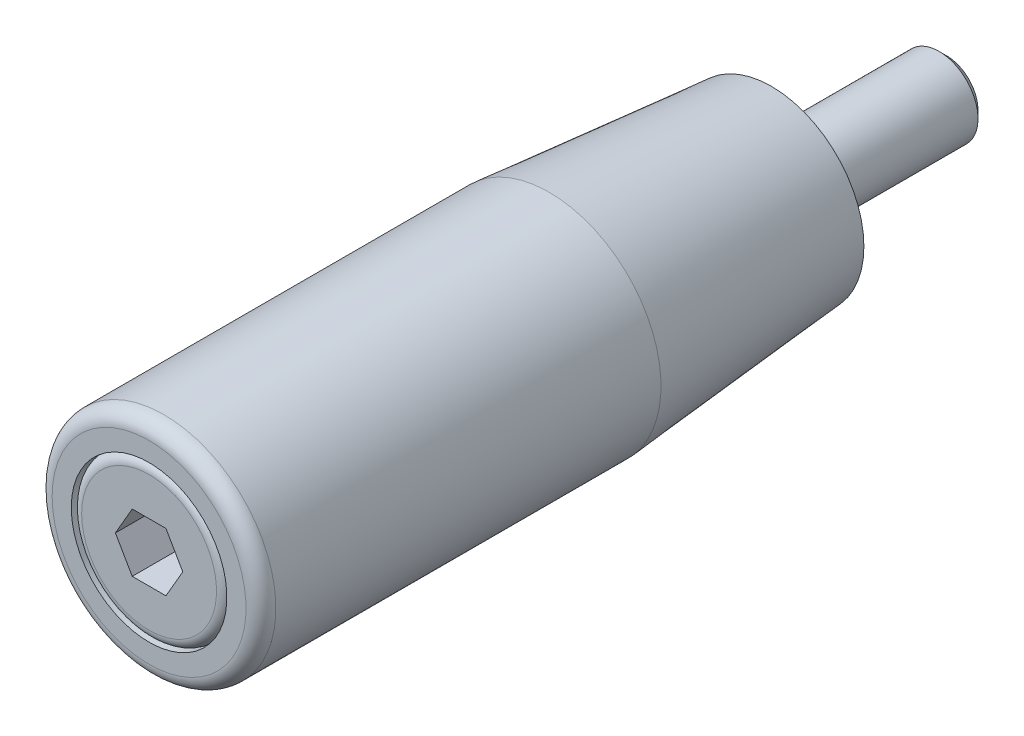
ISO-10303-21;
HEADER;
FILE_DESCRIPTION(('STEP AP214'),'2;1');
FILE_NAME('part.step','',(''),(''),'','','');
FILE_SCHEMA(('AUTOMOTIVE_DESIGN { 1 0 10303 214 1 1 1 1 }'));
ENDSEC;
DATA;
#1=APPLICATION_CONTEXT('core data for automotive mechanical design processes');
#2=APPLICATION_PROTOCOL_DEFINITION('international standard','automotive_design',2000,#1);
#3=PRODUCT_CONTEXT('',#1,'mechanical');
#4=PRODUCT('Part','Part','',(#3));
#5=PRODUCT_RELATED_PRODUCT_CATEGORY('part','',(#4));
#6=PRODUCT_DEFINITION_FORMATION('','',#4);
#7=PRODUCT_DEFINITION_CONTEXT('part definition',#1,'design');
#8=PRODUCT_DEFINITION('design','',#6,#7);
#9=PRODUCT_DEFINITION_SHAPE('','',#8);
#10=(LENGTH_UNIT() NAMED_UNIT(*) SI_UNIT(.MILLI.,.METRE.));
#11=(NAMED_UNIT(*) PLANE_ANGLE_UNIT() SI_UNIT($,.RADIAN.));
#12=(NAMED_UNIT(*) SI_UNIT($,.STERADIAN.) SOLID_ANGLE_UNIT());
#13=UNCERTAINTY_MEASURE_WITH_UNIT(LENGTH_MEASURE(1.E-05),#10,'distance_accuracy_value','');
#14=(GEOMETRIC_REPRESENTATION_CONTEXT(3) GLOBAL_UNCERTAINTY_ASSIGNED_CONTEXT((#13)) GLOBAL_UNIT_ASSIGNED_CONTEXT((#10,
#11,#12)) REPRESENTATION_CONTEXT('',''));
#15=CARTESIAN_POINT('',(0.,0.,0.));
#16=DIRECTION('',(0.,0.,1.));
#17=DIRECTION('',(1.,0.,0.));
#18=AXIS2_PLACEMENT_3D('',#15,#16,#17);
#19=CARTESIAN_POINT('',(0.,-3.,0.));
#20=DIRECTION('',(0.,0.,1.));
#21=DIRECTION('',(-1.,0.,0.));
#22=AXIS2_PLACEMENT_3D('',#19,#20,#21);
#23=PLANE('',#22);
#24=CARTESIAN_POINT('',(0.,0.,0.));
#25=DIRECTION('',(0.,0.,1.));
#26=DIRECTION('',(-1.,0.,0.));
#27=AXIS2_PLACEMENT_3D('',#24,#25,#26);
#28=CIRCLE('',#27,6.);
#29=CARTESIAN_POINT('',(-6.,0.,0.));
#30=VERTEX_POINT('',#29);
#31=EDGE_CURVE('E121',#30,#30,#28,.T.);
#32=ORIENTED_EDGE('',*,*,#31,.F.);
#33=EDGE_LOOP('',(#32));
#34=FACE_BOUND('',#33,.T.);
#35=CARTESIAN_POINT('',(0.,0.,0.));
#36=DIRECTION('',(0.,0.,1.));
#37=DIRECTION('',(-1.,0.,0.));
#38=AXIS2_PLACEMENT_3D('',#35,#36,#37);
#39=CIRCLE('',#38,3.);
#40=CARTESIAN_POINT('',(-3.,0.,0.));
#41=VERTEX_POINT('',#40);
#42=EDGE_CURVE('E124',#41,#41,#39,.T.);
#43=ORIENTED_EDGE('',*,*,#42,.T.);
#44=EDGE_LOOP('',(#43));
#45=FACE_BOUND('',#44,.T.);
#46=ADVANCED_FACE('F15',(#34,#45),#23,.F.);
#47=CARTESIAN_POINT('',(0.,-4.53892574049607E-13,65.));
#48=DIRECTION('',(0.,0.,1.));
#49=DIRECTION('',(-1.,0.,0.));
#50=AXIS2_PLACEMENT_3D('',#47,#48,#49);
#51=CYLINDRICAL_SURFACE('',#50,3.);
#52=ORIENTED_EDGE('',*,*,#42,.F.);
#53=EDGE_LOOP('',(#52));
#54=FACE_BOUND('',#53,.T.);
#55=CARTESIAN_POINT('',(0.,0.,-1.5));
#56=DIRECTION('',(0.,0.,1.));
#57=DIRECTION('',(-1.,0.,0.));
#58=AXIS2_PLACEMENT_3D('',#55,#56,#57);
#59=CIRCLE('',#58,3.);
#60=CARTESIAN_POINT('',(-3.,0.,-1.5));
#61=VERTEX_POINT('',#60);
#62=EDGE_CURVE('E127',#61,#61,#59,.T.);
#63=ORIENTED_EDGE('',*,*,#62,.T.);
#64=EDGE_LOOP('',(#63));
#65=FACE_BOUND('',#64,.T.);
#66=ADVANCED_FACE('F246',(#54,#65),#51,.T.);
#67=CARTESIAN_POINT('',(0.,-3.233,-1.50000000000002));
#68=DIRECTION('',(0.,0.,-1.));
#69=DIRECTION('',(1.,0.,0.));
#70=AXIS2_PLACEMENT_3D('',#67,#68,#69);
#71=PLANE('',#70);
#72=ORIENTED_EDGE('',*,*,#62,.F.);
#73=EDGE_LOOP('',(#72));
#74=FACE_BOUND('',#73,.T.);
#75=CARTESIAN_POINT('',(0.,0.,-1.5));
#76=DIRECTION('',(0.,0.,1.));
#77=DIRECTION('',(-1.,0.,0.));
#78=AXIS2_PLACEMENT_3D('',#75,#76,#77);
#79=CIRCLE('',#78,3.233);
#80=CARTESIAN_POINT('',(-3.233,0.,-1.5));
#81=VERTEX_POINT('',#80);
#82=EDGE_CURVE('E130',#81,#81,#79,.T.);
#83=ORIENTED_EDGE('',*,*,#82,.T.);
#84=EDGE_LOOP('',(#83));
#85=FACE_BOUND('',#84,.T.);
#86=ADVANCED_FACE('F242',(#74,#85),#71,.F.);
#87=CARTESIAN_POINT('',(0.,0.,-2.267));
#88=DIRECTION('',(0.,0.,-1.));
#89=DIRECTION('',(1.,0.,0.));
#90=AXIS2_PLACEMENT_3D('',#87,#88,#89);
#91=CONICAL_SURFACE('',#90,4.,0.785398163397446);
#92=ORIENTED_EDGE('',*,*,#82,.F.);
#93=EDGE_LOOP('',(#92));
#94=FACE_BOUND('',#93,.T.);
#95=CARTESIAN_POINT('',(0.,0.,-2.267));
#96=DIRECTION('',(0.,0.,1.));
#97=DIRECTION('',(-1.,0.,0.));
#98=AXIS2_PLACEMENT_3D('',#95,#96,#97);
#99=CIRCLE('',#98,4.);
#100=CARTESIAN_POINT('',(-4.,0.,-2.267));
#101=VERTEX_POINT('',#100);
#102=EDGE_CURVE('E133',#101,#101,#99,.T.);
#103=ORIENTED_EDGE('',*,*,#102,.T.);
#104=EDGE_LOOP('',(#103));
#105=FACE_BOUND('',#104,.T.);
#106=ADVANCED_FACE('F238',(#94,#105),#91,.T.);
#107=CARTESIAN_POINT('',(0.,-4.53892574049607E-13,65.));
#108=DIRECTION('',(0.,0.,1.));
#109=DIRECTION('',(-1.,0.,0.));
#110=AXIS2_PLACEMENT_3D('',#107,#108,#109);
#111=CYLINDRICAL_SURFACE('',#110,4.);
#112=ORIENTED_EDGE('',*,*,#102,.F.);
#113=EDGE_LOOP('',(#112));
#114=FACE_BOUND('',#113,.T.);
#115=CARTESIAN_POINT('',(0.,1.13354433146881E-13,-16.233));
#116=DIRECTION('',(0.,0.,1.));
#117=DIRECTION('',(-1.,0.,0.));
#118=AXIS2_PLACEMENT_3D('',#115,#116,#117);
#119=CIRCLE('',#118,4.);
#120=CARTESIAN_POINT('',(-4.,1.13354433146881E-13,-16.233));
#121=VERTEX_POINT('',#120);
#122=EDGE_CURVE('E136',#121,#121,#119,.T.);
#123=ORIENTED_EDGE('',*,*,#122,.T.);
#124=EDGE_LOOP('',(#123));
#125=FACE_BOUND('',#124,.T.);
#126=ADVANCED_FACE('F234',(#114,#125),#111,.T.);
#127=CARTESIAN_POINT('',(0.,1.18710365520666E-13,-17.));
#128=DIRECTION('',(0.,0.,1.));
#129=DIRECTION('',(-1.,0.,0.));
#130=AXIS2_PLACEMENT_3D('',#127,#128,#129);
#131=CONICAL_SURFACE('',#130,3.233,0.785398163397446);
#132=ORIENTED_EDGE('',*,*,#122,.F.);
#133=EDGE_LOOP('',(#132));
#134=FACE_BOUND('',#133,.T.);
#135=CARTESIAN_POINT('',(0.,1.18710365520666E-13,-17.));
#136=DIRECTION('',(0.,0.,1.));
#137=DIRECTION('',(-1.,0.,0.));
#138=AXIS2_PLACEMENT_3D('',#135,#136,#137);
#139=CIRCLE('',#138,3.233);
#140=CARTESIAN_POINT('',(-3.233,1.18710365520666E-13,-17.));
#141=VERTEX_POINT('',#140);
#142=EDGE_CURVE('E139',#141,#141,#139,.T.);
#143=ORIENTED_EDGE('',*,*,#142,.T.);
#144=EDGE_LOOP('',(#143));
#145=FACE_BOUND('',#144,.T.);
#146=ADVANCED_FACE('F230',(#134,#145),#131,.T.);
#147=CARTESIAN_POINT('',(0.,1.18710365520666E-13,-17.));
#148=DIRECTION('',(0.,0.,1.));
#149=DIRECTION('',(-1.,0.,0.));
#150=AXIS2_PLACEMENT_3D('',#147,#148,#149);
#151=PLANE('',#150);
#152=ORIENTED_EDGE('',*,*,#142,.F.);
#153=EDGE_LOOP('',(#152));
#154=FACE_BOUND('',#153,.T.);
#155=ADVANCED_FACE('F202',(#154),#151,.F.);
#156=CARTESIAN_POINT('',(0.,-4.53892574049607E-13,65.));
#157=DIRECTION('',(0.,0.,1.));
#158=DIRECTION('',(-1.,0.,0.));
#159=AXIS2_PLACEMENT_3D('',#156,#157,#158);
#160=CYLINDRICAL_SURFACE('',#159,6.);
#161=CARTESIAN_POINT('',(0.,0.,1.));
#162=DIRECTION('',(0.,0.,-1.));
#163=DIRECTION('',(1.,0.,0.));
#164=AXIS2_PLACEMENT_3D('',#161,#162,#163);
#165=CIRCLE('',#164,6.);
#166=CARTESIAN_POINT('',(6.,0.,1.));
#167=VERTEX_POINT('',#166);
#168=EDGE_CURVE('E9',#167,#167,#165,.T.);
#169=ORIENTED_EDGE('',*,*,#168,.T.);
#170=EDGE_LOOP('',(#169));
#171=FACE_BOUND('',#170,.T.);
#172=ORIENTED_EDGE('',*,*,#31,.T.);
#173=EDGE_LOOP('',(#172));
#174=FACE_BOUND('',#173,.T.);
#175=ADVANCED_FACE('F194',(#171,#174),#160,.T.);
#176=CARTESIAN_POINT('',(0.,-4.53892574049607E-13,65.));
#177=DIRECTION('',(0.,0.,1.));
#178=DIRECTION('',(-1.,0.,0.));
#179=AXIS2_PLACEMENT_3D('',#176,#177,#178);
#180=CYLINDRICAL_SURFACE('',#179,8.);
#181=CARTESIAN_POINT('',(0.,-4.53892574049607E-13,65.));
#182=DIRECTION('',(0.,0.,1.));
#183=DIRECTION('',(-1.,0.,0.));
#184=AXIS2_PLACEMENT_3D('',#181,#182,#183);
#185=CIRCLE('',#184,8.);
#186=CARTESIAN_POINT('',(-8.,-4.53892574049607E-13,65.));
#187=VERTEX_POINT('',#186);
#188=EDGE_CURVE('E167',#187,#187,#185,.T.);
#189=ORIENTED_EDGE('',*,*,#188,.T.);
#190=EDGE_LOOP('',(#189));
#191=FACE_BOUND('',#190,.T.);
#192=CARTESIAN_POINT('',(0.,-4.46444080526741E-13,63.9333333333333));
#193=DIRECTION('',(0.,0.,1.));
#194=DIRECTION('',(-1.,0.,0.));
#195=AXIS2_PLACEMENT_3D('',#192,#193,#194);
#196=CIRCLE('',#195,8.);
#197=CARTESIAN_POINT('',(-8.,-4.46444080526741E-13,63.9333333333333));
#198=VERTEX_POINT('',#197);
#199=EDGE_CURVE('E112',#198,#198,#196,.T.);
#200=ORIENTED_EDGE('',*,*,#199,.F.);
#201=EDGE_LOOP('',(#200));
#202=FACE_BOUND('',#201,.T.);
#203=ADVANCED_FACE('F180',(#191,#202),#180,.F.);
#204=CARTESIAN_POINT('',(0.,-8.00000000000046,65.));
#205=DIRECTION('',(0.,0.,1.));
#206=DIRECTION('',(-1.,0.,0.));
#207=AXIS2_PLACEMENT_3D('',#204,#205,#206);
#208=PLANE('',#207);
#209=CARTESIAN_POINT('',(0.,-4.53892574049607E-13,65.));
#210=DIRECTION('',(0.,0.,1.));
#211=DIRECTION('',(-1.,0.,0.));
#212=AXIS2_PLACEMENT_3D('',#209,#210,#211);
#213=CIRCLE('',#212,9.96666666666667);
#214=CARTESIAN_POINT('',(-9.96666666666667,-4.53892574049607E-13,65.));
#215=VERTEX_POINT('',#214);
#216=EDGE_CURVE('E165',#215,#215,#213,.T.);
#217=ORIENTED_EDGE('',*,*,#216,.T.);
#218=EDGE_LOOP('',(#217));
#219=FACE_BOUND('',#218,.T.);
#220=ORIENTED_EDGE('',*,*,#188,.F.);
#221=EDGE_LOOP('',(#220));
#222=FACE_BOUND('',#221,.T.);
#223=ADVANCED_FACE('F211',(#219,#222),#208,.T.);
#224=CARTESIAN_POINT('',(0.,-4.43185364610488E-13,63.4666666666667));
#225=DIRECTION('',(0.,0.,1.));
#226=DIRECTION('',(-1.,0.,0.));
#227=AXIS2_PLACEMENT_3D('',#224,#225,#226);
#228=TOROIDAL_SURFACE('',#227,9.96666666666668,1.53333333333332);
#229=CARTESIAN_POINT('',(0.,-4.43185364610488E-13,63.4666666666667));
#230=DIRECTION('',(0.,0.,1.));
#231=DIRECTION('',(-1.,0.,0.));
#232=AXIS2_PLACEMENT_3D('',#229,#230,#231);
#233=CIRCLE('',#232,11.5);
#234=CARTESIAN_POINT('',(-11.5,-4.43185364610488E-13,63.4666666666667));
#235=VERTEX_POINT('',#234);
#236=EDGE_CURVE('E162',#235,#235,#233,.T.);
#237=ORIENTED_EDGE('',*,*,#236,.T.);
#238=EDGE_LOOP('',(#237));
#239=FACE_BOUND('',#238,.T.);
#240=ORIENTED_EDGE('',*,*,#216,.F.);
#241=EDGE_LOOP('',(#240));
#242=FACE_BOUND('',#241,.T.);
#243=ADVANCED_FACE('F214',(#239,#242),#228,.T.);
#244=CARTESIAN_POINT('',(0.,-9.5,0.999999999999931));
#245=DIRECTION('',(0.,0.,-1.));
#246=DIRECTION('',(1.,0.,0.));
#247=AXIS2_PLACEMENT_3D('',#244,#245,#246);
#248=PLANE('',#247);
#249=ORIENTED_EDGE('',*,*,#168,.F.);
#250=EDGE_LOOP('',(#249));
#251=FACE_BOUND('',#250,.T.);
#252=CARTESIAN_POINT('',(0.,0.,1.));
#253=DIRECTION('',(0.,0.,1.));
#254=DIRECTION('',(-1.,0.,0.));
#255=AXIS2_PLACEMENT_3D('',#252,#253,#254);
#256=CIRCLE('',#255,9.5);
#257=CARTESIAN_POINT('',(-9.5,0.,1.));
#258=VERTEX_POINT('',#257);
#259=EDGE_CURVE('E156',#258,#258,#256,.T.);
#260=ORIENTED_EDGE('',*,*,#259,.F.);
#261=EDGE_LOOP('',(#260));
#262=FACE_BOUND('',#261,.T.);
#263=ADVANCED_FACE('F17',(#251,#262),#248,.T.);
#264=CARTESIAN_POINT('',(0.,-1.66614219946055E-13,23.8601046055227));
#265=DIRECTION('',(0.,0.,1.));
#266=DIRECTION('',(-1.,0.,0.));
#267=AXIS2_PLACEMENT_3D('',#264,#265,#266);
#268=CONICAL_SURFACE('',#267,11.5,0.0872664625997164);
#269=ORIENTED_EDGE('',*,*,#259,.T.);
#270=EDGE_LOOP('',(#269));
#271=FACE_BOUND('',#270,.T.);
#272=CARTESIAN_POINT('',(0.,-1.66614219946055E-13,23.8601046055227));
#273=DIRECTION('',(0.,0.,1.));
#274=DIRECTION('',(-1.,0.,0.));
#275=AXIS2_PLACEMENT_3D('',#272,#273,#274);
#276=CIRCLE('',#275,11.5);
#277=CARTESIAN_POINT('',(-11.5,-1.66614219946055E-13,23.8601046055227));
#278=VERTEX_POINT('',#277);
#279=EDGE_CURVE('E159',#278,#278,#276,.T.);
#280=ORIENTED_EDGE('',*,*,#279,.F.);
#281=EDGE_LOOP('',(#280));
#282=FACE_BOUND('',#281,.T.);
#283=ADVANCED_FACE('F223',(#271,#282),#268,.T.);
#284=CARTESIAN_POINT('',(0.,-4.53892574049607E-13,65.));
#285=DIRECTION('',(0.,0.,1.));
#286=DIRECTION('',(-1.,0.,0.));
#287=AXIS2_PLACEMENT_3D('',#284,#285,#286);
#288=CYLINDRICAL_SURFACE('',#287,11.5);
#289=ORIENTED_EDGE('',*,*,#279,.T.);
#290=EDGE_LOOP('',(#289));
#291=FACE_BOUND('',#290,.T.);
#292=ORIENTED_EDGE('',*,*,#236,.F.);
#293=EDGE_LOOP('',(#292));
#294=FACE_BOUND('',#293,.T.);
#295=ADVANCED_FACE('F219',(#291,#294),#288,.T.);
#296=CARTESIAN_POINT('',(0.,-4.46444080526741E-13,63.9333333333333));
#297=DIRECTION('',(0.,0.,1.));
#298=DIRECTION('',(-1.,0.,0.));
#299=AXIS2_PLACEMENT_3D('',#296,#297,#298);
#300=TOROIDAL_SURFACE('',#299,6.93333333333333,1.06666666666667);
#301=ORIENTED_EDGE('',*,*,#199,.T.);
#302=EDGE_LOOP('',(#301));
#303=FACE_BOUND('',#302,.T.);
#304=CARTESIAN_POINT('',(0.,-4.53892574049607E-13,65.));
#305=DIRECTION('',(0.,0.,1.));
#306=DIRECTION('',(-1.,0.,0.));
#307=AXIS2_PLACEMENT_3D('',#304,#305,#306);
#308=CIRCLE('',#307,6.93333333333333);
#309=CARTESIAN_POINT('',(-6.93333333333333,-4.53892574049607E-13,65.));
#310=VERTEX_POINT('',#309);
#311=EDGE_CURVE('E85',#310,#310,#308,.T.);
#312=ORIENTED_EDGE('',*,*,#311,.F.);
#313=EDGE_LOOP('',(#312));
#314=FACE_BOUND('',#313,.T.);
#315=ADVANCED_FACE('F222',(#303,#314),#300,.T.);
#316=CARTESIAN_POINT('',(0.,-6.93333333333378,65.));
#317=DIRECTION('',(0.,0.,-1.));
#318=DIRECTION('',(1.,0.,0.));
#319=AXIS2_PLACEMENT_3D('',#316,#317,#318);
#320=PLANE('',#319);
#321=DIRECTION('',(1.,0.,0.));
#322=VECTOR('',#321,1.);
#323=CARTESIAN_POINT('',(0.,-3.00000000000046,65.));
#324=LINE('',#323,#322);
#325=CARTESIAN_POINT('',(-1.73205080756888,-3.00000000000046,65.));
#326=VERTEX_POINT('',#325);
#327=CARTESIAN_POINT('',(1.73205080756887,-3.00000000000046,65.));
#328=VERTEX_POINT('',#327);
#329=EDGE_CURVE('E146',#326,#328,#324,.T.);
#330=ORIENTED_EDGE('',*,*,#329,.F.);
#331=DIRECTION('',(0.5,-0.866025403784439,0.));
#332=VECTOR('',#331,1.);
#333=CARTESIAN_POINT('',(0.404145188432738,-6.70000000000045,65.));
#334=LINE('',#333,#332);
#335=CARTESIAN_POINT('',(-3.46410161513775,-4.53892574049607E-13,65.));
#336=VERTEX_POINT('',#335);
#337=EDGE_CURVE('E148',#336,#326,#334,.T.);
#338=ORIENTED_EDGE('',*,*,#337,.F.);
#339=DIRECTION('',(-0.5,-0.866025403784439,0.));
#340=VECTOR('',#339,1.);
#341=CARTESIAN_POINT('',(-5.60029761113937,-3.70000000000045,65.));
#342=LINE('',#341,#340);
#343=CARTESIAN_POINT('',(-1.73205080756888,2.99999999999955,65.));
#344=VERTEX_POINT('',#343);
#345=EDGE_CURVE('E151',#344,#336,#342,.T.);
#346=ORIENTED_EDGE('',*,*,#345,.F.);
#347=DIRECTION('',(-1.,0.,0.));
#348=VECTOR('',#347,1.);
#349=CARTESIAN_POINT('',(0.,2.99999999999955,65.));
#350=LINE('',#349,#348);
#351=CARTESIAN_POINT('',(1.73205080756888,2.99999999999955,65.));
#352=VERTEX_POINT('',#351);
#353=EDGE_CURVE('E41',#352,#344,#350,.T.);
#354=ORIENTED_EDGE('',*,*,#353,.F.);
#355=DIRECTION('',(-0.5,0.866025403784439,0.));
#356=VECTOR('',#355,1.);
#357=CARTESIAN_POINT('',(5.60029761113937,-3.70000000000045,65.));
#358=LINE('',#357,#356);
#359=CARTESIAN_POINT('',(3.46410161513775,-4.53892574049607E-13,65.));
#360=VERTEX_POINT('',#359);
#361=EDGE_CURVE('E142',#360,#352,#358,.T.);
#362=ORIENTED_EDGE('',*,*,#361,.F.);
#363=DIRECTION('',(0.5,0.866025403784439,0.));
#364=VECTOR('',#363,1.);
#365=CARTESIAN_POINT('',(-0.404145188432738,-6.70000000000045,65.));
#366=LINE('',#365,#364);
#367=EDGE_CURVE('E144',#328,#360,#366,.T.);
#368=ORIENTED_EDGE('',*,*,#367,.F.);
#369=EDGE_LOOP('',(#330,#338,#346,#354,#362,#368));
#370=FACE_BOUND('',#369,.T.);
#371=ORIENTED_EDGE('',*,*,#311,.T.);
#372=EDGE_LOOP('',(#371));
#373=FACE_BOUND('',#372,.T.);
#374=ADVANCED_FACE('F273',(#370,#373),#320,.F.);
#375=CARTESIAN_POINT('',(-1.73205080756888,-3.00000000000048,69.5));
#376=DIRECTION('',(0.,1.,0.));
#377=DIRECTION('',(-1.,0.,0.));
#378=AXIS2_PLACEMENT_3D('',#375,#376,#377);
#379=PLANE('',#378);
#380=DIRECTION('',(0.,0.,-1.));
#381=VECTOR('',#380,1.);
#382=CARTESIAN_POINT('',(-1.73205080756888,-3.00000000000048,69.5));
#383=LINE('',#382,#381);
#384=CARTESIAN_POINT('',(-1.73205080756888,-3.00000000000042,60.5));
#385=VERTEX_POINT('',#384);
#386=EDGE_CURVE('E106',#326,#385,#383,.T.);
#387=ORIENTED_EDGE('',*,*,#386,.F.);
#388=ORIENTED_EDGE('',*,*,#329,.T.);
#389=DIRECTION('',(0.,0.,-1.));
#390=VECTOR('',#389,1.);
#391=CARTESIAN_POINT('',(1.73205080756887,-3.00000000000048,69.5));
#392=LINE('',#391,#390);
#393=CARTESIAN_POINT('',(1.73205080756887,-3.00000000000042,60.5));
#394=VERTEX_POINT('',#393);
#395=EDGE_CURVE('E103',#328,#394,#392,.T.);
#396=ORIENTED_EDGE('',*,*,#395,.T.);
#397=DIRECTION('',(1.,0.,0.));
#398=VECTOR('',#397,1.);
#399=CARTESIAN_POINT('',(-1.73205080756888,-3.00000000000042,60.5));
#400=LINE('',#399,#398);
#401=EDGE_CURVE('E93',#385,#394,#400,.T.);
#402=ORIENTED_EDGE('',*,*,#401,.F.);
#403=EDGE_LOOP('',(#387,#388,#396,#402));
#404=FACE_BOUND('',#403,.T.);
#405=ADVANCED_FACE('F269',(#404),#379,.T.);
#406=CARTESIAN_POINT('',(-3.46410161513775,-4.85315906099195E-13,69.5));
#407=DIRECTION('',(0.866025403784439,0.5,0.));
#408=DIRECTION('',(-0.5,0.866025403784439,0.));
#409=AXIS2_PLACEMENT_3D('',#406,#407,#408);
#410=PLANE('',#409);
#411=ORIENTED_EDGE('',*,*,#337,.T.);
#412=ORIENTED_EDGE('',*,*,#386,.T.);
#413=DIRECTION('',(0.5,-0.866025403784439,0.));
#414=VECTOR('',#413,1.);
#415=CARTESIAN_POINT('',(-3.46410161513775,-4.22469242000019E-13,60.5));
#416=LINE('',#415,#414);
#417=CARTESIAN_POINT('',(-3.46410161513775,-4.22469242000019E-13,60.5));
#418=VERTEX_POINT('',#417);
#419=EDGE_CURVE('E91',#418,#385,#416,.T.);
#420=ORIENTED_EDGE('',*,*,#419,.F.);
#421=DIRECTION('',(0.,0.,-1.));
#422=VECTOR('',#421,1.);
#423=CARTESIAN_POINT('',(-3.46410161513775,-4.85315906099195E-13,69.5));
#424=LINE('',#423,#422);
#425=EDGE_CURVE('E86',#336,#418,#424,.T.);
#426=ORIENTED_EDGE('',*,*,#425,.F.);
#427=EDGE_LOOP('',(#411,#412,#420,#426));
#428=FACE_BOUND('',#427,.T.);
#429=ADVANCED_FACE('F272',(#428),#410,.T.);
#430=CARTESIAN_POINT('',(-1.73205080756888,2.99999999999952,69.5));
#431=DIRECTION('',(0.866025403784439,-0.5,0.));
#432=DIRECTION('',(0.5,0.866025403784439,0.));
#433=AXIS2_PLACEMENT_3D('',#430,#431,#432);
#434=PLANE('',#433);
#435=ORIENTED_EDGE('',*,*,#345,.T.);
#436=ORIENTED_EDGE('',*,*,#425,.T.);
#437=DIRECTION('',(-0.5,-0.866025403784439,0.));
#438=VECTOR('',#437,1.);
#439=CARTESIAN_POINT('',(-1.73205080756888,2.99999999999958,60.5));
#440=LINE('',#439,#438);
#441=CARTESIAN_POINT('',(-1.73205080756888,2.99999999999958,60.5));
#442=VERTEX_POINT('',#441);
#443=EDGE_CURVE('E76',#442,#418,#440,.T.);
#444=ORIENTED_EDGE('',*,*,#443,.F.);
#445=DIRECTION('',(0.,0.,-1.));
#446=VECTOR('',#445,1.);
#447=CARTESIAN_POINT('',(-1.73205080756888,2.99999999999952,69.5));
#448=LINE('',#447,#446);
#449=EDGE_CURVE('E81',#344,#442,#448,.T.);
#450=ORIENTED_EDGE('',*,*,#449,.F.);
#451=EDGE_LOOP('',(#435,#436,#444,#450));
#452=FACE_BOUND('',#451,.T.);
#453=ADVANCED_FACE('F88',(#452),#434,.T.);
#454=CARTESIAN_POINT('',(1.73205080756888,2.99999999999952,69.5));
#455=DIRECTION('',(0.,-1.,0.));
#456=DIRECTION('',(1.,0.,0.));
#457=AXIS2_PLACEMENT_3D('',#454,#455,#456);
#458=PLANE('',#457);
#459=ORIENTED_EDGE('',*,*,#353,.T.);
#460=ORIENTED_EDGE('',*,*,#449,.T.);
#461=DIRECTION('',(-1.,0.,0.));
#462=VECTOR('',#461,1.);
#463=CARTESIAN_POINT('',(1.73205080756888,2.99999999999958,60.5));
#464=LINE('',#463,#462);
#465=CARTESIAN_POINT('',(1.73205080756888,2.99999999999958,60.5));
#466=VERTEX_POINT('',#465);
#467=EDGE_CURVE('E73',#466,#442,#464,.T.);
#468=ORIENTED_EDGE('',*,*,#467,.F.);
#469=DIRECTION('',(0.,0.,-1.));
#470=VECTOR('',#469,1.);
#471=CARTESIAN_POINT('',(1.73205080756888,2.99999999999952,69.5));
#472=LINE('',#471,#470);
#473=EDGE_CURVE('E100',#352,#466,#472,.T.);
#474=ORIENTED_EDGE('',*,*,#473,.F.);
#475=EDGE_LOOP('',(#459,#460,#468,#474));
#476=FACE_BOUND('',#475,.T.);
#477=ADVANCED_FACE('F82',(#476),#458,.T.);
#478=CARTESIAN_POINT('',(3.46410161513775,-4.85315906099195E-13,69.5));
#479=DIRECTION('',(-0.866025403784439,-0.5,0.));
#480=DIRECTION('',(0.5,-0.866025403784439,0.));
#481=AXIS2_PLACEMENT_3D('',#478,#479,#480);
#482=PLANE('',#481);
#483=ORIENTED_EDGE('',*,*,#361,.T.);
#484=ORIENTED_EDGE('',*,*,#473,.T.);
#485=DIRECTION('',(-0.5,0.866025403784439,0.));
#486=VECTOR('',#485,1.);
#487=CARTESIAN_POINT('',(3.46410161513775,-4.22469242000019E-13,60.5));
#488=LINE('',#487,#486);
#489=CARTESIAN_POINT('',(3.46410161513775,-4.22469242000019E-13,60.5));
#490=VERTEX_POINT('',#489);
#491=EDGE_CURVE('E78',#490,#466,#488,.T.);
#492=ORIENTED_EDGE('',*,*,#491,.F.);
#493=DIRECTION('',(0.,0.,-1.));
#494=VECTOR('',#493,1.);
#495=CARTESIAN_POINT('',(3.46410161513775,-4.85315906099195E-13,69.5));
#496=LINE('',#495,#494);
#497=EDGE_CURVE('E33',#360,#490,#496,.T.);
#498=ORIENTED_EDGE('',*,*,#497,.F.);
#499=EDGE_LOOP('',(#483,#484,#492,#498));
#500=FACE_BOUND('',#499,.T.);
#501=ADVANCED_FACE('F263',(#500),#482,.T.);
#502=CARTESIAN_POINT('',(1.73205080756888,-3.00000000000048,69.5));
#503=DIRECTION('',(-0.866025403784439,0.5,0.));
#504=DIRECTION('',(-0.5,-0.866025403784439,0.));
#505=AXIS2_PLACEMENT_3D('',#502,#503,#504);
#506=PLANE('',#505);
#507=ORIENTED_EDGE('',*,*,#367,.T.);
#508=ORIENTED_EDGE('',*,*,#497,.T.);
#509=DIRECTION('',(0.5,0.866025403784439,0.));
#510=VECTOR('',#509,1.);
#511=CARTESIAN_POINT('',(1.73205080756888,-3.00000000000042,60.5));
#512=LINE('',#511,#510);
#513=EDGE_CURVE('E97',#394,#490,#512,.T.);
#514=ORIENTED_EDGE('',*,*,#513,.F.);
#515=ORIENTED_EDGE('',*,*,#395,.F.);
#516=EDGE_LOOP('',(#507,#508,#514,#515));
#517=FACE_BOUND('',#516,.T.);
#518=ADVANCED_FACE('F257',(#517),#506,.T.);
#519=CARTESIAN_POINT('',(0.,-4.22469242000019E-13,60.5));
#520=DIRECTION('',(0.,0.,1.));
#521=DIRECTION('',(-1.,0.,0.));
#522=AXIS2_PLACEMENT_3D('',#519,#520,#521);
#523=PLANE('',#522);
#524=ORIENTED_EDGE('',*,*,#419,.T.);
#525=ORIENTED_EDGE('',*,*,#401,.T.);
#526=ORIENTED_EDGE('',*,*,#513,.T.);
#527=ORIENTED_EDGE('',*,*,#491,.T.);
#528=ORIENTED_EDGE('',*,*,#467,.T.);
#529=ORIENTED_EDGE('',*,*,#443,.T.);
#530=EDGE_LOOP('',(#524,#525,#526,#527,#528,#529));
#531=FACE_BOUND('',#530,.T.);
#532=ADVANCED_FACE('F74',(#531),#523,.T.);
#533=CLOSED_SHELL('',(#46,#66,#86,#106,#126,#146,#155,#175,#203,#223,#243,#263,#283,#295,#315,
#374,#405,#429,#453,#477,#501,#518,#532));
#534=CARTESIAN_POINT('',(0.,-3.98028872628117E-13,57.));
#535=DIRECTION('',(0.,0.,1.));
#536=DIRECTION('',(-1.,0.,0.));
#537=AXIS2_PLACEMENT_3D('',#534,#535,#536);
#538=CIRCLE('',#537,6.);
#539=CARTESIAN_POINT('',(-6.,-3.98028872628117E-13,57.));
#540=VERTEX_POINT('',#539);
#541=EDGE_CURVE('E25',#540,#540,#538,.T.);
#542=ORIENTED_EDGE('',*,*,#541,.T.);
#543=EDGE_LOOP('',(#542));
#544=FACE_BOUND('',#543,.T.);
#545=CARTESIAN_POINT('',(0.,-4.0710672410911E-13,58.3));
#546=DIRECTION('',(0.,0.,1.));
#547=DIRECTION('',(-1.,0.,0.));
#548=AXIS2_PLACEMENT_3D('',#545,#546,#547);
#549=CIRCLE('',#548,6.);
#550=CARTESIAN_POINT('',(-6.,-4.0710672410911E-13,58.3));
#551=VERTEX_POINT('',#550);
#552=EDGE_CURVE('E118',#551,#551,#549,.T.);
#553=ORIENTED_EDGE('',*,*,#552,.F.);
#554=EDGE_LOOP('',(#553));
#555=FACE_BOUND('',#554,.T.);
#556=ADVANCED_FACE('F181',(#544,#555),#160,.T.);
#557=CARTESIAN_POINT('',(0.,-6.00000000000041,58.3));
#558=DIRECTION('',(0.,0.,1.));
#559=DIRECTION('',(-1.,0.,0.));
#560=AXIS2_PLACEMENT_3D('',#557,#558,#559);
#561=PLANE('',#560);
#562=CARTESIAN_POINT('',(0.,-4.0710672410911E-13,58.3));
#563=DIRECTION('',(0.,0.,1.));
#564=DIRECTION('',(-1.,0.,0.));
#565=AXIS2_PLACEMENT_3D('',#562,#563,#564);
#566=CIRCLE('',#565,8.);
#567=CARTESIAN_POINT('',(-8.,-4.0710672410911E-13,58.3));
#568=VERTEX_POINT('',#567);
#569=EDGE_CURVE('E115',#568,#568,#566,.T.);
#570=ORIENTED_EDGE('',*,*,#569,.F.);
#571=EDGE_LOOP('',(#570));
#572=FACE_BOUND('',#571,.T.);
#573=ORIENTED_EDGE('',*,*,#552,.T.);
#574=EDGE_LOOP('',(#573));
#575=FACE_BOUND('',#574,.T.);
#576=ADVANCED_FACE('F185',(#572,#575),#561,.F.);
#577=CARTESIAN_POINT('',(0.,-6.0000000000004,57.));
#578=DIRECTION('',(0.,0.,1.));
#579=DIRECTION('',(-1.,0.,0.));
#580=AXIS2_PLACEMENT_3D('',#577,#578,#579);
#581=PLANE('',#580);
#582=ORIENTED_EDGE('',*,*,#541,.F.);
#583=EDGE_LOOP('',(#582));
#584=FACE_BOUND('',#583,.T.);
#585=CARTESIAN_POINT('',(0.,-3.98028872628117E-13,57.));
#586=DIRECTION('',(0.,0.,1.));
#587=DIRECTION('',(-1.,0.,0.));
#588=AXIS2_PLACEMENT_3D('',#585,#586,#587);
#589=CIRCLE('',#588,8.);
#590=CARTESIAN_POINT('',(-8.,-3.98028872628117E-13,57.));
#591=VERTEX_POINT('',#590);
#592=EDGE_CURVE('E19',#591,#591,#589,.T.);
#593=ORIENTED_EDGE('',*,*,#592,.T.);
#594=EDGE_LOOP('',(#593));
#595=FACE_BOUND('',#594,.T.);
#596=ADVANCED_FACE('F174',(#584,#595),#581,.T.);
#597=ORIENTED_EDGE('',*,*,#592,.F.);
#598=EDGE_LOOP('',(#597));
#599=FACE_BOUND('',#598,.T.);
#600=ORIENTED_EDGE('',*,*,#569,.T.);
#601=EDGE_LOOP('',(#600));
#602=FACE_BOUND('',#601,.T.);
#603=ADVANCED_FACE('F176',(#599,#602),#180,.F.);
#604=CLOSED_SHELL('',(#556,#576,#596,#603));
#605=ORIENTED_CLOSED_SHELL('',*,#604,.T.);
#606=BREP_WITH_VOIDS('B1',#533,(#605));
#607=ADVANCED_BREP_SHAPE_REPRESENTATION('',(#18,#606),#14);
#608=SHAPE_DEFINITION_REPRESENTATION(#9,#607);
ENDSEC;
END-ISO-10303-21;
